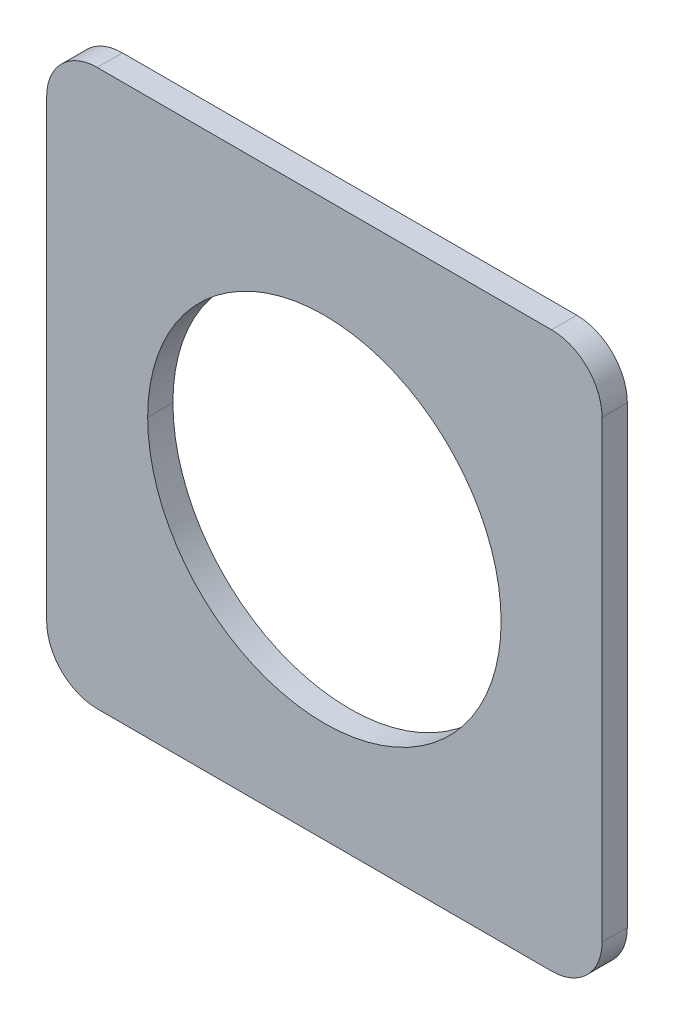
ISO-10303-21;
HEADER;
FILE_DESCRIPTION(('STEP AP214'),'2;1');
FILE_NAME('part.step','',(''),(''),'','','');
FILE_SCHEMA(('AUTOMOTIVE_DESIGN { 1 0 10303 214 1 1 1 1 }'));
ENDSEC;
DATA;
#1=APPLICATION_CONTEXT('core data for automotive mechanical design processes');
#2=APPLICATION_PROTOCOL_DEFINITION('international standard','automotive_design',2000,#1);
#3=PRODUCT_CONTEXT('',#1,'mechanical');
#4=PRODUCT('Part','Part','',(#3));
#5=PRODUCT_RELATED_PRODUCT_CATEGORY('part','',(#4));
#6=PRODUCT_DEFINITION_FORMATION('','',#4);
#7=PRODUCT_DEFINITION_CONTEXT('part definition',#1,'design');
#8=PRODUCT_DEFINITION('design','',#6,#7);
#9=PRODUCT_DEFINITION_SHAPE('','',#8);
#10=(LENGTH_UNIT() NAMED_UNIT(*) SI_UNIT(.MILLI.,.METRE.));
#11=(NAMED_UNIT(*) PLANE_ANGLE_UNIT() SI_UNIT($,.RADIAN.));
#12=(NAMED_UNIT(*) SI_UNIT($,.STERADIAN.) SOLID_ANGLE_UNIT());
#13=UNCERTAINTY_MEASURE_WITH_UNIT(LENGTH_MEASURE(1.E-05),#10,'distance_accuracy_value','');
#14=(GEOMETRIC_REPRESENTATION_CONTEXT(3) GLOBAL_UNCERTAINTY_ASSIGNED_CONTEXT((#13)) GLOBAL_UNIT_ASSIGNED_CONTEXT((#10,
#11,#12)) REPRESENTATION_CONTEXT('',''));
#15=CARTESIAN_POINT('',(0.,0.,0.));
#16=DIRECTION('',(0.,0.,1.));
#17=DIRECTION('',(1.,0.,0.));
#18=AXIS2_PLACEMENT_3D('',#15,#16,#17);
#19=CARTESIAN_POINT('',(-5.5,5.5,0.));
#20=DIRECTION('',(-1.,0.,0.));
#21=DIRECTION('',(0.,0.,1.));
#22=AXIS2_PLACEMENT_3D('',#19,#20,#21);
#23=PLANE('',#22);
#24=DIRECTION('',(0.,-1.,0.));
#25=VECTOR('',#24,1.);
#26=CARTESIAN_POINT('',(-5.5,4.5,0.));
#27=LINE('',#26,#25);
#28=CARTESIAN_POINT('',(-5.5,4.5,0.));
#29=VERTEX_POINT('',#28);
#30=CARTESIAN_POINT('',(-5.5,-4.5,0.));
#31=VERTEX_POINT('',#30);
#32=EDGE_CURVE('E162',#29,#31,#27,.T.);
#33=ORIENTED_EDGE('',*,*,#32,.T.);
#34=DIRECTION('',(0.,0.,-1.));
#35=VECTOR('',#34,1.);
#36=CARTESIAN_POINT('',(-5.5,-4.5,0.5));
#37=LINE('',#36,#35);
#38=CARTESIAN_POINT('',(-5.5,-4.5,0.5));
#39=VERTEX_POINT('',#38);
#40=EDGE_CURVE('E11',#39,#31,#37,.T.);
#41=ORIENTED_EDGE('',*,*,#40,.F.);
#42=DIRECTION('',(0.,-1.,0.));
#43=VECTOR('',#42,1.);
#44=CARTESIAN_POINT('',(-5.5,4.5,0.5));
#45=LINE('',#44,#43);
#46=CARTESIAN_POINT('',(-5.5,4.5,0.5));
#47=VERTEX_POINT('',#46);
#48=EDGE_CURVE('E178',#47,#39,#45,.T.);
#49=ORIENTED_EDGE('',*,*,#48,.F.);
#50=DIRECTION('',(0.,0.,-1.));
#51=VECTOR('',#50,1.);
#52=CARTESIAN_POINT('',(-5.5,4.5,0.5));
#53=LINE('',#52,#51);
#54=EDGE_CURVE('E222',#47,#29,#53,.T.);
#55=ORIENTED_EDGE('',*,*,#54,.T.);
#56=EDGE_LOOP('',(#33,#41,#49,#55));
#57=FACE_BOUND('',#56,.T.);
#58=ADVANCED_FACE('F17',(#57),#23,.T.);
#59=CARTESIAN_POINT('',(-4.5,-4.5,1.753));
#60=DIRECTION('',(0.,0.,-1.));
#61=DIRECTION('',(0.,-1.,0.));
#62=AXIS2_PLACEMENT_3D('',#59,#60,#61);
#63=CYLINDRICAL_SURFACE('',#62,1.);
#64=DIRECTION('',(0.,0.,-1.));
#65=VECTOR('',#64,1.);
#66=CARTESIAN_POINT('',(-4.5,-5.5,0.5));
#67=LINE('',#66,#65);
#68=CARTESIAN_POINT('',(-4.5,-5.5,0.5));
#69=VERTEX_POINT('',#68);
#70=CARTESIAN_POINT('',(-4.5,-5.5,0.));
#71=VERTEX_POINT('',#70);
#72=EDGE_CURVE('E26',#69,#71,#67,.T.);
#73=ORIENTED_EDGE('',*,*,#72,.F.);
#74=CARTESIAN_POINT('',(-4.5,-4.5,0.5));
#75=DIRECTION('',(0.,0.,1.));
#76=DIRECTION('',(-1.,0.,0.));
#77=AXIS2_PLACEMENT_3D('',#74,#75,#76);
#78=CIRCLE('',#77,1.);
#79=EDGE_CURVE('E195',#39,#69,#78,.T.);
#80=ORIENTED_EDGE('',*,*,#79,.F.);
#81=ORIENTED_EDGE('',*,*,#40,.T.);
#82=CARTESIAN_POINT('',(-4.5,-4.5,0.));
#83=DIRECTION('',(0.,0.,-1.));
#84=DIRECTION('',(0.,-1.,0.));
#85=AXIS2_PLACEMENT_3D('',#82,#83,#84);
#86=CIRCLE('',#85,1.);
#87=EDGE_CURVE('E141',#71,#31,#86,.T.);
#88=ORIENTED_EDGE('',*,*,#87,.F.);
#89=EDGE_LOOP('',(#73,#80,#81,#88));
#90=FACE_BOUND('',#89,.T.);
#91=ADVANCED_FACE('F237',(#90),#63,.T.);
#92=CARTESIAN_POINT('',(-5.5,-5.5,0.));
#93=DIRECTION('',(0.,-1.,0.));
#94=DIRECTION('',(0.,0.,-1.));
#95=AXIS2_PLACEMENT_3D('',#92,#93,#94);
#96=PLANE('',#95);
#97=DIRECTION('',(1.,0.,0.));
#98=VECTOR('',#97,1.);
#99=CARTESIAN_POINT('',(-4.5,-5.5,0.));
#100=LINE('',#99,#98);
#101=CARTESIAN_POINT('',(4.5,-5.5,0.));
#102=VERTEX_POINT('',#101);
#103=EDGE_CURVE('E135',#71,#102,#100,.T.);
#104=ORIENTED_EDGE('',*,*,#103,.T.);
#105=DIRECTION('',(0.,0.,-1.));
#106=VECTOR('',#105,1.);
#107=CARTESIAN_POINT('',(4.5,-5.5,0.5));
#108=LINE('',#107,#106);
#109=CARTESIAN_POINT('',(4.5,-5.5,0.5));
#110=VERTEX_POINT('',#109);
#111=EDGE_CURVE('E121',#110,#102,#108,.T.);
#112=ORIENTED_EDGE('',*,*,#111,.F.);
#113=DIRECTION('',(1.,0.,0.));
#114=VECTOR('',#113,1.);
#115=CARTESIAN_POINT('',(-4.5,-5.5,0.5));
#116=LINE('',#115,#114);
#117=EDGE_CURVE('E199',#69,#110,#116,.T.);
#118=ORIENTED_EDGE('',*,*,#117,.F.);
#119=ORIENTED_EDGE('',*,*,#72,.T.);
#120=EDGE_LOOP('',(#104,#112,#118,#119));
#121=FACE_BOUND('',#120,.T.);
#122=ADVANCED_FACE('F136',(#121),#96,.T.);
#123=CARTESIAN_POINT('',(4.5,-4.5,1.753));
#124=DIRECTION('',(0.,0.,-1.));
#125=DIRECTION('',(1.,0.,0.));
#126=AXIS2_PLACEMENT_3D('',#123,#124,#125);
#127=CYLINDRICAL_SURFACE('',#126,1.);
#128=DIRECTION('',(0.,0.,-1.));
#129=VECTOR('',#128,1.);
#130=CARTESIAN_POINT('',(5.5,-4.5,0.5));
#131=LINE('',#130,#129);
#132=CARTESIAN_POINT('',(5.5,-4.5,0.5));
#133=VERTEX_POINT('',#132);
#134=CARTESIAN_POINT('',(5.5,-4.5,0.));
#135=VERTEX_POINT('',#134);
#136=EDGE_CURVE('E132',#133,#135,#131,.T.);
#137=ORIENTED_EDGE('',*,*,#136,.F.);
#138=CARTESIAN_POINT('',(4.5,-4.5,0.5));
#139=DIRECTION('',(0.,0.,1.));
#140=DIRECTION('',(0.,-1.,0.));
#141=AXIS2_PLACEMENT_3D('',#138,#139,#140);
#142=CIRCLE('',#141,1.);
#143=EDGE_CURVE('E127',#110,#133,#142,.T.);
#144=ORIENTED_EDGE('',*,*,#143,.F.);
#145=ORIENTED_EDGE('',*,*,#111,.T.);
#146=CARTESIAN_POINT('',(4.5,-4.5,0.));
#147=DIRECTION('',(0.,0.,-1.));
#148=DIRECTION('',(1.,0.,0.));
#149=AXIS2_PLACEMENT_3D('',#146,#147,#148);
#150=CIRCLE('',#149,1.);
#151=EDGE_CURVE('E124',#135,#102,#150,.T.);
#152=ORIENTED_EDGE('',*,*,#151,.F.);
#153=EDGE_LOOP('',(#137,#144,#145,#152));
#154=FACE_BOUND('',#153,.T.);
#155=ADVANCED_FACE('F19',(#154),#127,.T.);
#156=CARTESIAN_POINT('',(5.5,-5.5,0.));
#157=DIRECTION('',(1.,0.,0.));
#158=DIRECTION('',(0.,1.,0.));
#159=AXIS2_PLACEMENT_3D('',#156,#157,#158);
#160=PLANE('',#159);
#161=DIRECTION('',(0.,1.,0.));
#162=VECTOR('',#161,1.);
#163=CARTESIAN_POINT('',(5.5,-4.5,0.5));
#164=LINE('',#163,#162);
#165=CARTESIAN_POINT('',(5.5,4.5,0.5));
#166=VERTEX_POINT('',#165);
#167=EDGE_CURVE('E204',#133,#166,#164,.T.);
#168=ORIENTED_EDGE('',*,*,#167,.F.);
#169=ORIENTED_EDGE('',*,*,#136,.T.);
#170=DIRECTION('',(0.,1.,0.));
#171=VECTOR('',#170,1.);
#172=CARTESIAN_POINT('',(5.5,-4.5,0.));
#173=LINE('',#172,#171);
#174=CARTESIAN_POINT('',(5.5,4.5,0.));
#175=VERTEX_POINT('',#174);
#176=EDGE_CURVE('E147',#135,#175,#173,.T.);
#177=ORIENTED_EDGE('',*,*,#176,.T.);
#178=DIRECTION('',(0.,0.,-1.));
#179=VECTOR('',#178,1.);
#180=CARTESIAN_POINT('',(5.5,4.5,0.5));
#181=LINE('',#180,#179);
#182=EDGE_CURVE('E183',#166,#175,#181,.T.);
#183=ORIENTED_EDGE('',*,*,#182,.F.);
#184=EDGE_LOOP('',(#168,#169,#177,#183));
#185=FACE_BOUND('',#184,.T.);
#186=ADVANCED_FACE('F306',(#185),#160,.T.);
#187=CARTESIAN_POINT('',(4.5,4.5,1.753));
#188=DIRECTION('',(0.,0.,-1.));
#189=DIRECTION('',(0.,1.,0.));
#190=AXIS2_PLACEMENT_3D('',#187,#188,#189);
#191=CYLINDRICAL_SURFACE('',#190,1.);
#192=DIRECTION('',(0.,0.,-1.));
#193=VECTOR('',#192,1.);
#194=CARTESIAN_POINT('',(4.5,5.5,0.5));
#195=LINE('',#194,#193);
#196=CARTESIAN_POINT('',(4.5,5.5,0.5));
#197=VERTEX_POINT('',#196);
#198=CARTESIAN_POINT('',(4.5,5.5,0.));
#199=VERTEX_POINT('',#198);
#200=EDGE_CURVE('E48',#197,#199,#195,.T.);
#201=ORIENTED_EDGE('',*,*,#200,.F.);
#202=CARTESIAN_POINT('',(4.5,4.5,0.5));
#203=DIRECTION('',(0.,0.,1.));
#204=DIRECTION('',(1.,0.,0.));
#205=AXIS2_PLACEMENT_3D('',#202,#203,#204);
#206=CIRCLE('',#205,1.);
#207=EDGE_CURVE('E208',#166,#197,#206,.T.);
#208=ORIENTED_EDGE('',*,*,#207,.F.);
#209=ORIENTED_EDGE('',*,*,#182,.T.);
#210=CARTESIAN_POINT('',(4.5,4.5,0.));
#211=DIRECTION('',(0.,0.,-1.));
#212=DIRECTION('',(0.,1.,0.));
#213=AXIS2_PLACEMENT_3D('',#210,#211,#212);
#214=CIRCLE('',#213,1.);
#215=EDGE_CURVE('E153',#199,#175,#214,.T.);
#216=ORIENTED_EDGE('',*,*,#215,.F.);
#217=EDGE_LOOP('',(#201,#208,#209,#216));
#218=FACE_BOUND('',#217,.T.);
#219=ADVANCED_FACE('F299',(#218),#191,.T.);
#220=CARTESIAN_POINT('',(5.5,5.5,0.));
#221=DIRECTION('',(0.,1.,0.));
#222=DIRECTION('',(1.,0.,0.));
#223=AXIS2_PLACEMENT_3D('',#220,#221,#222);
#224=PLANE('',#223);
#225=DIRECTION('',(-1.,0.,0.));
#226=VECTOR('',#225,1.);
#227=CARTESIAN_POINT('',(4.5,5.5,0.5));
#228=LINE('',#227,#226);
#229=CARTESIAN_POINT('',(-4.5,5.5,0.5));
#230=VERTEX_POINT('',#229);
#231=EDGE_CURVE('E214',#197,#230,#228,.T.);
#232=ORIENTED_EDGE('',*,*,#231,.F.);
#233=ORIENTED_EDGE('',*,*,#200,.T.);
#234=DIRECTION('',(-1.,0.,0.));
#235=VECTOR('',#234,1.);
#236=CARTESIAN_POINT('',(4.5,5.5,0.));
#237=LINE('',#236,#235);
#238=CARTESIAN_POINT('',(-4.5,5.5,0.));
#239=VERTEX_POINT('',#238);
#240=EDGE_CURVE('E359',#199,#239,#237,.T.);
#241=ORIENTED_EDGE('',*,*,#240,.T.);
#242=DIRECTION('',(0.,0.,-1.));
#243=VECTOR('',#242,1.);
#244=CARTESIAN_POINT('',(-4.5,5.5,0.5));
#245=LINE('',#244,#243);
#246=EDGE_CURVE('E38',#230,#239,#245,.T.);
#247=ORIENTED_EDGE('',*,*,#246,.F.);
#248=EDGE_LOOP('',(#232,#233,#241,#247));
#249=FACE_BOUND('',#248,.T.);
#250=ADVANCED_FACE('F291',(#249),#224,.T.);
#251=CARTESIAN_POINT('',(-4.5,4.5,1.753));
#252=DIRECTION('',(0.,0.,-1.));
#253=DIRECTION('',(-1.,0.,0.));
#254=AXIS2_PLACEMENT_3D('',#251,#252,#253);
#255=CYLINDRICAL_SURFACE('',#254,1.);
#256=ORIENTED_EDGE('',*,*,#54,.F.);
#257=CARTESIAN_POINT('',(-4.5,4.5,0.5));
#258=DIRECTION('',(0.,0.,1.));
#259=DIRECTION('',(0.,1.,0.));
#260=AXIS2_PLACEMENT_3D('',#257,#258,#259);
#261=CIRCLE('',#260,1.);
#262=EDGE_CURVE('E218',#230,#47,#261,.T.);
#263=ORIENTED_EDGE('',*,*,#262,.F.);
#264=ORIENTED_EDGE('',*,*,#246,.T.);
#265=CARTESIAN_POINT('',(-4.5,4.5,0.));
#266=DIRECTION('',(0.,0.,-1.));
#267=DIRECTION('',(-1.,0.,0.));
#268=AXIS2_PLACEMENT_3D('',#265,#266,#267);
#269=CIRCLE('',#268,1.);
#270=EDGE_CURVE('E158',#29,#239,#269,.T.);
#271=ORIENTED_EDGE('',*,*,#270,.F.);
#272=EDGE_LOOP('',(#256,#263,#264,#271));
#273=FACE_BOUND('',#272,.T.);
#274=ADVANCED_FACE('F270',(#273),#255,.T.);
#275=CARTESIAN_POINT('',(0.,0.,0.5));
#276=DIRECTION('',(0.,0.,1.));
#277=DIRECTION('',(1.,0.,0.));
#278=AXIS2_PLACEMENT_3D('',#275,#276,#277);
#279=PLANE('',#278);
#280=CARTESIAN_POINT('',(0.,0.,0.5));
#281=DIRECTION('',(0.,0.,-1.));
#282=DIRECTION('',(-1.,0.,0.));
#283=AXIS2_PLACEMENT_3D('',#280,#281,#282);
#284=CIRCLE('',#283,3.5);
#285=CARTESIAN_POINT('',(-3.5,0.,0.5));
#286=VERTEX_POINT('',#285);
#287=CARTESIAN_POINT('',(3.5,0.,0.5));
#288=VERTEX_POINT('',#287);
#289=EDGE_CURVE('E175',#286,#288,#284,.T.);
#290=ORIENTED_EDGE('',*,*,#289,.T.);
#291=CARTESIAN_POINT('',(0.,0.,0.5));
#292=DIRECTION('',(0.,0.,-1.));
#293=DIRECTION('',(1.,0.,0.));
#294=AXIS2_PLACEMENT_3D('',#291,#292,#293);
#295=CIRCLE('',#294,3.5);
#296=EDGE_CURVE('E164',#288,#286,#295,.T.);
#297=ORIENTED_EDGE('',*,*,#296,.T.);
#298=EDGE_LOOP('',(#290,#297));
#299=FACE_BOUND('',#298,.T.);
#300=ORIENTED_EDGE('',*,*,#48,.T.);
#301=ORIENTED_EDGE('',*,*,#79,.T.);
#302=ORIENTED_EDGE('',*,*,#117,.T.);
#303=ORIENTED_EDGE('',*,*,#143,.T.);
#304=ORIENTED_EDGE('',*,*,#167,.T.);
#305=ORIENTED_EDGE('',*,*,#207,.T.);
#306=ORIENTED_EDGE('',*,*,#231,.T.);
#307=ORIENTED_EDGE('',*,*,#262,.T.);
#308=EDGE_LOOP('',(#300,#301,#302,#303,#304,#305,#306,#307));
#309=FACE_BOUND('',#308,.T.);
#310=ADVANCED_FACE('F262',(#299,#309),#279,.T.);
#311=CARTESIAN_POINT('',(0.,0.,0.));
#312=DIRECTION('',(0.,0.,1.));
#313=DIRECTION('',(1.,0.,0.));
#314=AXIS2_PLACEMENT_3D('',#311,#312,#313);
#315=CYLINDRICAL_SURFACE('',#314,3.5);
#316=DIRECTION('',(0.,0.,1.));
#317=VECTOR('',#316,1.);
#318=CARTESIAN_POINT('',(3.5,0.,0.));
#319=LINE('',#318,#317);
#320=CARTESIAN_POINT('',(3.5,0.,0.));
#321=VERTEX_POINT('',#320);
#322=EDGE_CURVE('E168',#321,#288,#319,.T.);
#323=ORIENTED_EDGE('',*,*,#322,.T.);
#324=ORIENTED_EDGE('',*,*,#289,.F.);
#325=DIRECTION('',(0.,0.,1.));
#326=VECTOR('',#325,1.);
#327=CARTESIAN_POINT('',(-3.5,0.,0.));
#328=LINE('',#327,#326);
#329=CARTESIAN_POINT('',(-3.5,0.,0.));
#330=VERTEX_POINT('',#329);
#331=EDGE_CURVE('E169',#330,#286,#328,.T.);
#332=ORIENTED_EDGE('',*,*,#331,.F.);
#333=CARTESIAN_POINT('',(0.,0.,0.));
#334=DIRECTION('',(0.,0.,-1.));
#335=DIRECTION('',(-1.,0.,0.));
#336=AXIS2_PLACEMENT_3D('',#333,#334,#335);
#337=CIRCLE('',#336,3.5);
#338=EDGE_CURVE('E161',#330,#321,#337,.T.);
#339=ORIENTED_EDGE('',*,*,#338,.T.);
#340=EDGE_LOOP('',(#323,#324,#332,#339));
#341=FACE_BOUND('',#340,.T.);
#342=ADVANCED_FACE('F254',(#341),#315,.F.);
#343=CARTESIAN_POINT('',(0.,0.,0.));
#344=DIRECTION('',(0.,0.,1.));
#345=DIRECTION('',(1.,0.,0.));
#346=AXIS2_PLACEMENT_3D('',#343,#344,#345);
#347=CYLINDRICAL_SURFACE('',#346,3.5);
#348=ORIENTED_EDGE('',*,*,#331,.T.);
#349=ORIENTED_EDGE('',*,*,#296,.F.);
#350=ORIENTED_EDGE('',*,*,#322,.F.);
#351=CARTESIAN_POINT('',(0.,0.,0.));
#352=DIRECTION('',(0.,0.,-1.));
#353=DIRECTION('',(1.,0.,0.));
#354=AXIS2_PLACEMENT_3D('',#351,#352,#353);
#355=CIRCLE('',#354,3.5);
#356=EDGE_CURVE('E182',#321,#330,#355,.T.);
#357=ORIENTED_EDGE('',*,*,#356,.T.);
#358=EDGE_LOOP('',(#348,#349,#350,#357));
#359=FACE_BOUND('',#358,.T.);
#360=ADVANCED_FACE('F246',(#359),#347,.F.);
#361=CARTESIAN_POINT('',(0.,0.,0.));
#362=DIRECTION('',(0.,0.,1.));
#363=DIRECTION('',(1.,0.,0.));
#364=AXIS2_PLACEMENT_3D('',#361,#362,#363);
#365=PLANE('',#364);
#366=ORIENTED_EDGE('',*,*,#338,.F.);
#367=ORIENTED_EDGE('',*,*,#356,.F.);
#368=EDGE_LOOP('',(#366,#367));
#369=FACE_BOUND('',#368,.T.);
#370=ORIENTED_EDGE('',*,*,#240,.F.);
#371=ORIENTED_EDGE('',*,*,#215,.T.);
#372=ORIENTED_EDGE('',*,*,#176,.F.);
#373=ORIENTED_EDGE('',*,*,#151,.T.);
#374=ORIENTED_EDGE('',*,*,#103,.F.);
#375=ORIENTED_EDGE('',*,*,#87,.T.);
#376=ORIENTED_EDGE('',*,*,#32,.F.);
#377=ORIENTED_EDGE('',*,*,#270,.T.);
#378=EDGE_LOOP('',(#370,#371,#372,#373,#374,#375,#376,#377));
#379=FACE_BOUND('',#378,.T.);
#380=ADVANCED_FACE('F144',(#369,#379),#365,.F.);
#381=CLOSED_SHELL('',(#58,#91,#122,#155,#186,#219,#250,#274,#310,#342,#360,#380));
#382=MANIFOLD_SOLID_BREP('B1',#381);
#383=ADVANCED_BREP_SHAPE_REPRESENTATION('',(#18,#382),#14);
#384=SHAPE_DEFINITION_REPRESENTATION(#9,#383);
ENDSEC;
END-ISO-10303-21;
